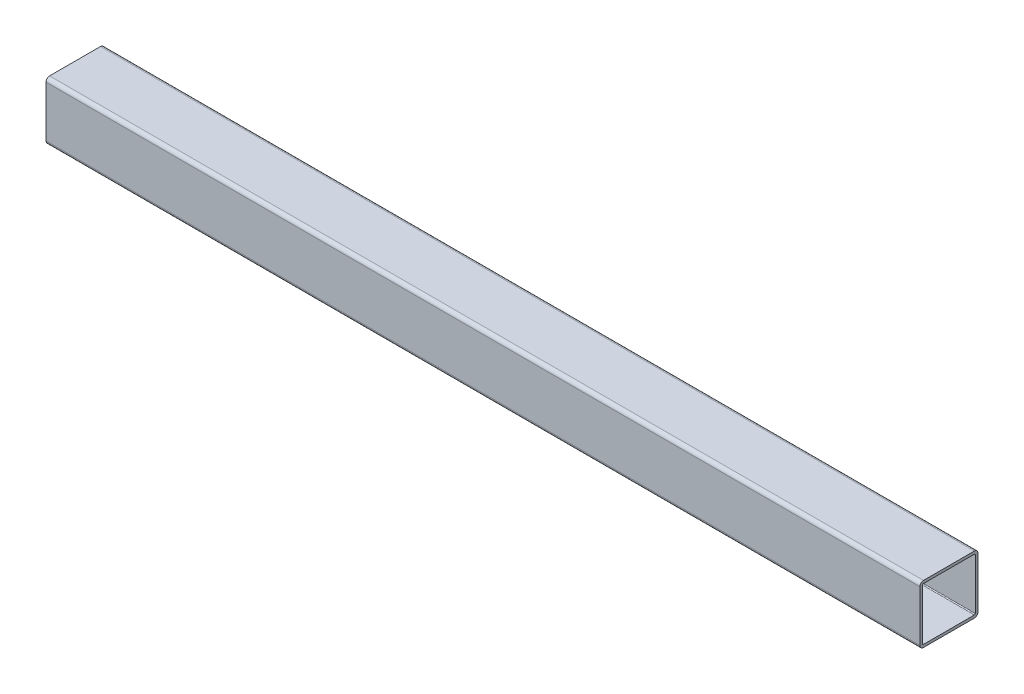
ISO-10303-21;
HEADER;
FILE_DESCRIPTION(('STEP AP214'),'2;1');
FILE_NAME('part.step','',(''),(''),'','','');
FILE_SCHEMA(('AUTOMOTIVE_DESIGN { 1 0 10303 214 1 1 1 1 }'));
ENDSEC;
DATA;
#1=APPLICATION_CONTEXT('core data for automotive mechanical design processes');
#2=APPLICATION_PROTOCOL_DEFINITION('international standard','automotive_design',2000,#1);
#3=PRODUCT_CONTEXT('',#1,'mechanical');
#4=PRODUCT('Part','Part','',(#3));
#5=PRODUCT_RELATED_PRODUCT_CATEGORY('part','',(#4));
#6=PRODUCT_DEFINITION_FORMATION('','',#4);
#7=PRODUCT_DEFINITION_CONTEXT('part definition',#1,'design');
#8=PRODUCT_DEFINITION('design','',#6,#7);
#9=PRODUCT_DEFINITION_SHAPE('','',#8);
#10=(LENGTH_UNIT() NAMED_UNIT(*) SI_UNIT(.MILLI.,.METRE.));
#11=(NAMED_UNIT(*) PLANE_ANGLE_UNIT() SI_UNIT($,.RADIAN.));
#12=(NAMED_UNIT(*) SI_UNIT($,.STERADIAN.) SOLID_ANGLE_UNIT());
#13=UNCERTAINTY_MEASURE_WITH_UNIT(LENGTH_MEASURE(1.E-05),#10,'distance_accuracy_value','');
#14=(GEOMETRIC_REPRESENTATION_CONTEXT(3) GLOBAL_UNCERTAINTY_ASSIGNED_CONTEXT((#13)) GLOBAL_UNIT_ASSIGNED_CONTEXT((#10,
#11,#12)) REPRESENTATION_CONTEXT('',''));
#15=CARTESIAN_POINT('',(0.,0.,0.));
#16=DIRECTION('',(0.,0.,1.));
#17=DIRECTION('',(1.,0.,0.));
#18=AXIS2_PLACEMENT_3D('',#15,#16,#17);
#19=CARTESIAN_POINT('',(-228.6,44.4500000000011,-46.0375));
#20=DIRECTION('',(0.,0.,-1.));
#21=DIRECTION('',(0.,1.,0.));
#22=AXIS2_PLACEMENT_3D('',#19,#20,#21);
#23=PLANE('',#22);
#24=DIRECTION('',(1.,0.,0.));
#25=VECTOR('',#24,1.);
#26=CARTESIAN_POINT('',(-228.6,44.4500000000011,-46.0374999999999));
#27=LINE('',#26,#25);
#28=CARTESIAN_POINT('',(1057.148,44.4500000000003,-46.0375));
#29=VERTEX_POINT('',#28);
#30=CARTESIAN_POINT('',(-470.661999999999,44.4500000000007,-46.0374999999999));
#31=VERTEX_POINT('',#30);
#32=EDGE_CURVE('E211',#29,#31,#27,.F.);
#33=ORIENTED_EDGE('',*,*,#32,.T.);
#34=DIRECTION('',(0.,-1.,0.));
#35=VECTOR('',#34,1.);
#36=CARTESIAN_POINT('',(-470.661999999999,44.4500000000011,-46.0375));
#37=LINE('',#36,#35);
#38=CARTESIAN_POINT('',(-470.661999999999,-44.4500000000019,-46.0375));
#39=VERTEX_POINT('',#38);
#40=EDGE_CURVE('E287',#31,#39,#37,.T.);
#41=ORIENTED_EDGE('',*,*,#40,.T.);
#42=DIRECTION('',(1.,0.,0.));
#43=VECTOR('',#42,1.);
#44=CARTESIAN_POINT('',(-228.6,-44.4500000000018,-46.0375));
#45=LINE('',#44,#43);
#46=CARTESIAN_POINT('',(1057.148,-44.4500000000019,-46.0375));
#47=VERTEX_POINT('',#46);
#48=EDGE_CURVE('E208',#39,#47,#45,.T.);
#49=ORIENTED_EDGE('',*,*,#48,.T.);
#50=DIRECTION('',(0.,1.,0.));
#51=VECTOR('',#50,1.);
#52=CARTESIAN_POINT('',(1057.148,-44.4500000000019,-46.0375));
#53=LINE('',#52,#51);
#54=EDGE_CURVE('E248',#47,#29,#53,.T.);
#55=ORIENTED_EDGE('',*,*,#54,.T.);
#56=EDGE_LOOP('',(#33,#41,#49,#55));
#57=FACE_BOUND('',#56,.T.);
#58=ADVANCED_FACE('F38',(#57),#23,.F.);
#59=CARTESIAN_POINT('',(-228.6,44.4500000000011,-44.45));
#60=DIRECTION('',(1.,0.,0.));
#61=DIRECTION('',(0.,1.,0.));
#62=AXIS2_PLACEMENT_3D('',#59,#60,#61);
#63=CYLINDRICAL_SURFACE('',#62,1.58749999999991);
#64=DIRECTION('',(1.,0.,0.));
#65=VECTOR('',#64,1.);
#66=CARTESIAN_POINT('',(-228.6,46.0375000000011,-44.45));
#67=LINE('',#66,#65);
#68=CARTESIAN_POINT('',(1057.148,46.037500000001,-44.45));
#69=VERTEX_POINT('',#68);
#70=CARTESIAN_POINT('',(-470.661999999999,46.0375000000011,-44.45));
#71=VERTEX_POINT('',#70);
#72=EDGE_CURVE('E192',#69,#71,#67,.F.);
#73=ORIENTED_EDGE('',*,*,#72,.T.);
#74=CARTESIAN_POINT('',(-470.661999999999,44.4500000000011,-44.45));
#75=DIRECTION('',(1.,0.,0.));
#76=DIRECTION('',(0.,1.,0.));
#77=AXIS2_PLACEMENT_3D('',#74,#75,#76);
#78=CIRCLE('',#77,1.58749999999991);
#79=EDGE_CURVE('E289',#71,#31,#78,.F.);
#80=ORIENTED_EDGE('',*,*,#79,.T.);
#81=ORIENTED_EDGE('',*,*,#32,.F.);
#82=CARTESIAN_POINT('',(1057.148,44.4500000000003,-44.45));
#83=DIRECTION('',(1.,0.,0.));
#84=DIRECTION('',(0.,1.,0.));
#85=AXIS2_PLACEMENT_3D('',#82,#83,#84);
#86=CIRCLE('',#85,1.58750000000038);
#87=EDGE_CURVE('E265',#29,#69,#86,.T.);
#88=ORIENTED_EDGE('',*,*,#87,.T.);
#89=EDGE_LOOP('',(#73,#80,#81,#88));
#90=FACE_BOUND('',#89,.T.);
#91=ADVANCED_FACE('F390',(#90),#63,.F.);
#92=CARTESIAN_POINT('',(-228.6,-46.0375000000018,-44.45));
#93=DIRECTION('',(0.,-1.,0.));
#94=DIRECTION('',(1.,0.,0.));
#95=AXIS2_PLACEMENT_3D('',#92,#93,#94);
#96=PLANE('',#95);
#97=DIRECTION('',(1.,0.,0.));
#98=VECTOR('',#97,1.);
#99=CARTESIAN_POINT('',(-228.6,-46.0375000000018,-44.45));
#100=LINE('',#99,#98);
#101=CARTESIAN_POINT('',(1057.148,-46.0375000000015,-44.45));
#102=VERTEX_POINT('',#101);
#103=CARTESIAN_POINT('',(-470.661999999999,-46.0375000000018,-44.45));
#104=VERTEX_POINT('',#103);
#105=EDGE_CURVE('E207',#102,#104,#100,.F.);
#106=ORIENTED_EDGE('',*,*,#105,.T.);
#107=DIRECTION('',(0.,0.,1.));
#108=VECTOR('',#107,1.);
#109=CARTESIAN_POINT('',(-470.661999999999,-46.0375000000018,-44.45));
#110=LINE('',#109,#108);
#111=CARTESIAN_POINT('',(-470.661999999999,-46.0375000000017,44.45));
#112=VERTEX_POINT('',#111);
#113=EDGE_CURVE('E292',#104,#112,#110,.T.);
#114=ORIENTED_EDGE('',*,*,#113,.T.);
#115=DIRECTION('',(1.,0.,0.));
#116=VECTOR('',#115,1.);
#117=CARTESIAN_POINT('',(-228.6,-46.0375000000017,44.45));
#118=LINE('',#117,#116);
#119=CARTESIAN_POINT('',(1057.148,-46.0375000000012,44.45));
#120=VERTEX_POINT('',#119);
#121=EDGE_CURVE('E164',#112,#120,#118,.T.);
#122=ORIENTED_EDGE('',*,*,#121,.T.);
#123=DIRECTION('',(0.,0.,-1.));
#124=VECTOR('',#123,1.);
#125=CARTESIAN_POINT('',(1057.148,-46.0375000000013,44.45));
#126=LINE('',#125,#124);
#127=EDGE_CURVE('E253',#120,#102,#126,.T.);
#128=ORIENTED_EDGE('',*,*,#127,.T.);
#129=EDGE_LOOP('',(#106,#114,#122,#128));
#130=FACE_BOUND('',#129,.T.);
#131=ADVANCED_FACE('F399',(#130),#96,.F.);
#132=CARTESIAN_POINT('',(-228.6,-44.4500000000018,-44.45));
#133=DIRECTION('',(1.,0.,0.));
#134=DIRECTION('',(0.,1.,0.));
#135=AXIS2_PLACEMENT_3D('',#132,#133,#134);
#136=CYLINDRICAL_SURFACE('',#135,1.5875);
#137=ORIENTED_EDGE('',*,*,#48,.F.);
#138=CARTESIAN_POINT('',(-470.661999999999,-44.4500000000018,-44.45));
#139=DIRECTION('',(1.,0.,0.));
#140=DIRECTION('',(0.,1.,0.));
#141=AXIS2_PLACEMENT_3D('',#138,#139,#140);
#142=CIRCLE('',#141,1.5875);
#143=EDGE_CURVE('E284',#39,#104,#142,.F.);
#144=ORIENTED_EDGE('',*,*,#143,.T.);
#145=ORIENTED_EDGE('',*,*,#105,.F.);
#146=CARTESIAN_POINT('',(1057.148,-44.4500000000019,-44.45));
#147=DIRECTION('',(1.,0.,0.));
#148=DIRECTION('',(0.,1.,0.));
#149=AXIS2_PLACEMENT_3D('',#146,#147,#148);
#150=CIRCLE('',#149,1.58749999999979);
#151=EDGE_CURVE('E250',#102,#47,#150,.T.);
#152=ORIENTED_EDGE('',*,*,#151,.T.);
#153=EDGE_LOOP('',(#137,#144,#145,#152));
#154=FACE_BOUND('',#153,.T.);
#155=ADVANCED_FACE('F410',(#154),#136,.F.);
#156=CARTESIAN_POINT('',(-228.6,-50.8000000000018,-44.45));
#157=DIRECTION('',(0.,-1.,0.));
#158=DIRECTION('',(0.,0.,-1.));
#159=AXIS2_PLACEMENT_3D('',#156,#157,#158);
#160=PLANE('',#159);
#161=DIRECTION('',(0.,0.,1.));
#162=VECTOR('',#161,1.);
#163=CARTESIAN_POINT('',(-470.661999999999,-50.8000000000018,-44.45));
#164=LINE('',#163,#162);
#165=CARTESIAN_POINT('',(-470.661999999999,-50.8000000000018,-44.45));
#166=VERTEX_POINT('',#165);
#167=CARTESIAN_POINT('',(-470.661999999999,-50.8000000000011,44.45));
#168=VERTEX_POINT('',#167);
#169=EDGE_CURVE('E278',#166,#168,#164,.T.);
#170=ORIENTED_EDGE('',*,*,#169,.F.);
#171=DIRECTION('',(1.,0.,0.));
#172=VECTOR('',#171,1.);
#173=CARTESIAN_POINT('',(-228.6,-50.8000000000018,-44.45));
#174=LINE('',#173,#172);
#175=CARTESIAN_POINT('',(1057.148,-50.8000000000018,-44.45));
#176=VERTEX_POINT('',#175);
#177=EDGE_CURVE('E188',#176,#166,#174,.F.);
#178=ORIENTED_EDGE('',*,*,#177,.F.);
#179=DIRECTION('',(0.,0.,-1.));
#180=VECTOR('',#179,1.);
#181=CARTESIAN_POINT('',(1057.148,-50.8000000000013,44.45));
#182=LINE('',#181,#180);
#183=CARTESIAN_POINT('',(1057.148,-50.8000000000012,44.45));
#184=VERTEX_POINT('',#183);
#185=EDGE_CURVE('E182',#184,#176,#182,.T.);
#186=ORIENTED_EDGE('',*,*,#185,.F.);
#187=DIRECTION('',(1.,0.,0.));
#188=VECTOR('',#187,1.);
#189=CARTESIAN_POINT('',(-228.6,-50.8000000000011,44.45));
#190=LINE('',#189,#188);
#191=EDGE_CURVE('E204',#168,#184,#190,.T.);
#192=ORIENTED_EDGE('',*,*,#191,.F.);
#193=EDGE_LOOP('',(#170,#178,#186,#192));
#194=FACE_BOUND('',#193,.T.);
#195=ADVANCED_FACE('F324',(#194),#160,.T.);
#196=CARTESIAN_POINT('',(-228.6,-44.4500000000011,44.45));
#197=DIRECTION('',(1.,0.,0.));
#198=DIRECTION('',(0.,1.,0.));
#199=AXIS2_PLACEMENT_3D('',#196,#197,#198);
#200=CYLINDRICAL_SURFACE('',#199,6.35);
#201=CARTESIAN_POINT('',(-470.661999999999,-44.4500000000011,44.45));
#202=DIRECTION('',(1.,0.,0.));
#203=DIRECTION('',(0.,1.,0.));
#204=AXIS2_PLACEMENT_3D('',#201,#202,#203);
#205=CIRCLE('',#204,6.35);
#206=CARTESIAN_POINT('',(-470.661999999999,-44.4500000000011,50.8));
#207=VERTEX_POINT('',#206);
#208=EDGE_CURVE('E52',#168,#207,#205,.F.);
#209=ORIENTED_EDGE('',*,*,#208,.F.);
#210=ORIENTED_EDGE('',*,*,#191,.T.);
#211=CARTESIAN_POINT('',(1057.148,-44.4500000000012,44.45));
#212=DIRECTION('',(1.,0.,0.));
#213=DIRECTION('',(0.,1.,0.));
#214=AXIS2_PLACEMENT_3D('',#211,#212,#213);
#215=CIRCLE('',#214,6.35000000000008);
#216=CARTESIAN_POINT('',(1057.148,-44.4500000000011,50.8));
#217=VERTEX_POINT('',#216);
#218=EDGE_CURVE('E222',#217,#184,#215,.T.);
#219=ORIENTED_EDGE('',*,*,#218,.F.);
#220=DIRECTION('',(1.,0.,0.));
#221=VECTOR('',#220,1.);
#222=CARTESIAN_POINT('',(-228.6,-44.4500000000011,50.8));
#223=LINE('',#222,#221);
#224=EDGE_CURVE('E202',#207,#217,#223,.T.);
#225=ORIENTED_EDGE('',*,*,#224,.F.);
#226=EDGE_LOOP('',(#209,#210,#219,#225));
#227=FACE_BOUND('',#226,.T.);
#228=ADVANCED_FACE('F321',(#227),#200,.T.);
#229=CARTESIAN_POINT('',(-228.6,-44.4500000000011,50.8));
#230=DIRECTION('',(0.,0.,1.));
#231=DIRECTION('',(1.,0.,0.));
#232=AXIS2_PLACEMENT_3D('',#229,#230,#231);
#233=PLANE('',#232);
#234=DIRECTION('',(0.,1.,0.));
#235=VECTOR('',#234,1.);
#236=CARTESIAN_POINT('',(-470.662,-2545.54181399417,50.8000000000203));
#237=LINE('',#236,#235);
#238=CARTESIAN_POINT('',(-470.661999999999,44.4500000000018,50.8));
#239=VERTEX_POINT('',#238);
#240=EDGE_CURVE('E60',#207,#239,#237,.T.);
#241=ORIENTED_EDGE('',*,*,#240,.F.);
#242=ORIENTED_EDGE('',*,*,#224,.T.);
#243=DIRECTION('',(0.,-1.,0.));
#244=VECTOR('',#243,1.);
#245=CARTESIAN_POINT('',(1057.148,44.4500000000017,50.8));
#246=LINE('',#245,#244);
#247=CARTESIAN_POINT('',(1057.148,44.4500000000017,50.8000000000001));
#248=VERTEX_POINT('',#247);
#249=EDGE_CURVE('E228',#248,#217,#246,.T.);
#250=ORIENTED_EDGE('',*,*,#249,.F.);
#251=DIRECTION('',(1.,0.,0.));
#252=VECTOR('',#251,1.);
#253=CARTESIAN_POINT('',(-228.6,44.4500000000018,50.8));
#254=LINE('',#253,#252);
#255=EDGE_CURVE('E199',#239,#248,#254,.T.);
#256=ORIENTED_EDGE('',*,*,#255,.F.);
#257=EDGE_LOOP('',(#241,#242,#250,#256));
#258=FACE_BOUND('',#257,.T.);
#259=ADVANCED_FACE('F320',(#258),#233,.T.);
#260=CARTESIAN_POINT('',(-228.6,44.4500000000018,44.45));
#261=DIRECTION('',(1.,0.,0.));
#262=DIRECTION('',(0.,1.,0.));
#263=AXIS2_PLACEMENT_3D('',#260,#261,#262);
#264=CYLINDRICAL_SURFACE('',#263,6.35);
#265=CARTESIAN_POINT('',(-470.661999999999,44.4500000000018,44.45));
#266=DIRECTION('',(1.,0.,0.));
#267=DIRECTION('',(0.,1.,0.));
#268=AXIS2_PLACEMENT_3D('',#265,#266,#267);
#269=CIRCLE('',#268,6.35);
#270=CARTESIAN_POINT('',(-470.661999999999,50.8000000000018,44.45));
#271=VERTEX_POINT('',#270);
#272=EDGE_CURVE('E268',#239,#271,#269,.F.);
#273=ORIENTED_EDGE('',*,*,#272,.F.);
#274=ORIENTED_EDGE('',*,*,#255,.T.);
#275=CARTESIAN_POINT('',(1057.148,44.4500000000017,44.45));
#276=DIRECTION('',(1.,0.,0.));
#277=DIRECTION('',(0.,1.,0.));
#278=AXIS2_PLACEMENT_3D('',#275,#276,#277);
#279=CIRCLE('',#278,6.35000000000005);
#280=CARTESIAN_POINT('',(1057.148,50.8000000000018,44.45));
#281=VERTEX_POINT('',#280);
#282=EDGE_CURVE('E231',#281,#248,#279,.T.);
#283=ORIENTED_EDGE('',*,*,#282,.F.);
#284=DIRECTION('',(1.,0.,0.));
#285=VECTOR('',#284,1.);
#286=CARTESIAN_POINT('',(-228.6,50.8000000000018,44.45));
#287=LINE('',#286,#285);
#288=EDGE_CURVE('E196',#271,#281,#287,.T.);
#289=ORIENTED_EDGE('',*,*,#288,.F.);
#290=EDGE_LOOP('',(#273,#274,#283,#289));
#291=FACE_BOUND('',#290,.T.);
#292=ADVANCED_FACE('F316',(#291),#264,.T.);
#293=CARTESIAN_POINT('',(-228.6,50.8000000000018,44.45));
#294=DIRECTION('',(0.,1.,0.));
#295=DIRECTION('',(0.,0.,1.));
#296=AXIS2_PLACEMENT_3D('',#293,#294,#295);
#297=PLANE('',#296);
#298=DIRECTION('',(0.,0.,-1.));
#299=VECTOR('',#298,1.);
#300=CARTESIAN_POINT('',(-470.661999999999,50.8000000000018,44.45));
#301=LINE('',#300,#299);
#302=CARTESIAN_POINT('',(-470.661999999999,50.8000000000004,-44.45));
#303=VERTEX_POINT('',#302);
#304=EDGE_CURVE('E271',#271,#303,#301,.T.);
#305=ORIENTED_EDGE('',*,*,#304,.F.);
#306=ORIENTED_EDGE('',*,*,#288,.T.);
#307=DIRECTION('',(0.,0.,1.));
#308=VECTOR('',#307,1.);
#309=CARTESIAN_POINT('',(1057.148,50.8000000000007,-44.45));
#310=LINE('',#309,#308);
#311=CARTESIAN_POINT('',(1057.148,50.8000000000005,-44.45));
#312=VERTEX_POINT('',#311);
#313=EDGE_CURVE('E236',#312,#281,#310,.T.);
#314=ORIENTED_EDGE('',*,*,#313,.F.);
#315=DIRECTION('',(1.,0.,0.));
#316=VECTOR('',#315,1.);
#317=CARTESIAN_POINT('',(-228.6,50.8000000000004,-44.45));
#318=LINE('',#317,#316);
#319=EDGE_CURVE('E194',#303,#312,#318,.T.);
#320=ORIENTED_EDGE('',*,*,#319,.F.);
#321=EDGE_LOOP('',(#305,#306,#314,#320));
#322=FACE_BOUND('',#321,.T.);
#323=ADVANCED_FACE('F312',(#322),#297,.T.);
#324=CARTESIAN_POINT('',(-228.6,44.4500000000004,-44.45));
#325=DIRECTION('',(1.,0.,0.));
#326=DIRECTION('',(0.,1.,0.));
#327=AXIS2_PLACEMENT_3D('',#324,#325,#326);
#328=CYLINDRICAL_SURFACE('',#327,6.35);
#329=CARTESIAN_POINT('',(-470.661999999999,44.4500000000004,-44.45));
#330=DIRECTION('',(1.,0.,0.));
#331=DIRECTION('',(0.,1.,0.));
#332=AXIS2_PLACEMENT_3D('',#329,#330,#331);
#333=CIRCLE('',#332,6.35);
#334=CARTESIAN_POINT('',(-470.661999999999,44.4500000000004,-50.8));
#335=VERTEX_POINT('',#334);
#336=EDGE_CURVE('E274',#303,#335,#333,.F.);
#337=ORIENTED_EDGE('',*,*,#336,.F.);
#338=ORIENTED_EDGE('',*,*,#319,.T.);
#339=CARTESIAN_POINT('',(1057.148,44.4500000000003,-44.45));
#340=DIRECTION('',(1.,0.,0.));
#341=DIRECTION('',(0.,1.,0.));
#342=AXIS2_PLACEMENT_3D('',#339,#340,#341);
#343=CIRCLE('',#342,6.35000000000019);
#344=CARTESIAN_POINT('',(1057.148,44.4500000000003,-50.8));
#345=VERTEX_POINT('',#344);
#346=EDGE_CURVE('E240',#345,#312,#343,.T.);
#347=ORIENTED_EDGE('',*,*,#346,.F.);
#348=DIRECTION('',(-1.,0.,0.));
#349=VECTOR('',#348,1.);
#350=CARTESIAN_POINT('',(-228.6,44.4500000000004,-50.8));
#351=LINE('',#350,#349);
#352=EDGE_CURVE('E189',#335,#345,#351,.F.);
#353=ORIENTED_EDGE('',*,*,#352,.F.);
#354=EDGE_LOOP('',(#337,#338,#347,#353));
#355=FACE_BOUND('',#354,.T.);
#356=ADVANCED_FACE('F308',(#355),#328,.T.);
#357=CARTESIAN_POINT('',(-228.6,44.4500000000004,-50.8));
#358=DIRECTION('',(0.,0.,-1.));
#359=DIRECTION('',(-1.,0.,0.));
#360=AXIS2_PLACEMENT_3D('',#357,#358,#359);
#361=PLANE('',#360);
#362=DIRECTION('',(0.,1.,0.));
#363=VECTOR('',#362,1.);
#364=CARTESIAN_POINT('',(-470.662,-2545.54181399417,-50.7999999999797));
#365=LINE('',#364,#363);
#366=CARTESIAN_POINT('',(-470.661999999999,-44.4500000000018,-50.8));
#367=VERTEX_POINT('',#366);
#368=EDGE_CURVE('E297',#367,#335,#365,.T.);
#369=ORIENTED_EDGE('',*,*,#368,.T.);
#370=ORIENTED_EDGE('',*,*,#352,.T.);
#371=DIRECTION('',(0.,1.,0.));
#372=VECTOR('',#371,1.);
#373=CARTESIAN_POINT('',(1057.148,-44.4500000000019,-50.8));
#374=LINE('',#373,#372);
#375=CARTESIAN_POINT('',(1057.148,-44.4500000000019,-50.8));
#376=VERTEX_POINT('',#375);
#377=EDGE_CURVE('E243',#376,#345,#374,.T.);
#378=ORIENTED_EDGE('',*,*,#377,.F.);
#379=DIRECTION('',(1.,0.,0.));
#380=VECTOR('',#379,1.);
#381=CARTESIAN_POINT('',(-228.6,-44.4500000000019,-50.8));
#382=LINE('',#381,#380);
#383=EDGE_CURVE('E185',#367,#376,#382,.T.);
#384=ORIENTED_EDGE('',*,*,#383,.F.);
#385=EDGE_LOOP('',(#369,#370,#378,#384));
#386=FACE_BOUND('',#385,.T.);
#387=ADVANCED_FACE('F303',(#386),#361,.T.);
#388=CARTESIAN_POINT('',(-228.6,-44.4500000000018,-44.45));
#389=DIRECTION('',(1.,0.,0.));
#390=DIRECTION('',(0.,1.,0.));
#391=AXIS2_PLACEMENT_3D('',#388,#389,#390);
#392=CYLINDRICAL_SURFACE('',#391,6.35);
#393=CARTESIAN_POINT('',(-470.661999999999,-44.4500000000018,-44.45));
#394=DIRECTION('',(1.,0.,0.));
#395=DIRECTION('',(0.,1.,0.));
#396=AXIS2_PLACEMENT_3D('',#393,#394,#395);
#397=CIRCLE('',#396,6.35);
#398=EDGE_CURVE('E281',#367,#166,#397,.F.);
#399=ORIENTED_EDGE('',*,*,#398,.F.);
#400=ORIENTED_EDGE('',*,*,#383,.T.);
#401=CARTESIAN_POINT('',(1057.148,-44.4500000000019,-44.45));
#402=DIRECTION('',(1.,0.,0.));
#403=DIRECTION('',(0.,1.,0.));
#404=AXIS2_PLACEMENT_3D('',#401,#402,#403);
#405=CIRCLE('',#404,6.34999999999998);
#406=EDGE_CURVE('E246',#176,#376,#405,.T.);
#407=ORIENTED_EDGE('',*,*,#406,.F.);
#408=ORIENTED_EDGE('',*,*,#177,.T.);
#409=EDGE_LOOP('',(#399,#400,#407,#408));
#410=FACE_BOUND('',#409,.T.);
#411=ADVANCED_FACE('F326',(#410),#392,.T.);
#412=CARTESIAN_POINT('',(-228.6,46.0375000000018,44.45));
#413=DIRECTION('',(0.,1.,0.));
#414=DIRECTION('',(0.,0.,1.));
#415=AXIS2_PLACEMENT_3D('',#412,#413,#414);
#416=PLANE('',#415);
#417=DIRECTION('',(1.,0.,0.));
#418=VECTOR('',#417,1.);
#419=CARTESIAN_POINT('',(-228.6,46.0375000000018,44.45));
#420=LINE('',#419,#418);
#421=CARTESIAN_POINT('',(1057.148,46.037500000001,44.45));
#422=VERTEX_POINT('',#421);
#423=CARTESIAN_POINT('',(-470.661999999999,46.0375000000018,44.45));
#424=VERTEX_POINT('',#423);
#425=EDGE_CURVE('E172',#422,#424,#420,.F.);
#426=ORIENTED_EDGE('',*,*,#425,.T.);
#427=DIRECTION('',(0.,0.,-1.));
#428=VECTOR('',#427,1.);
#429=CARTESIAN_POINT('',(-470.661999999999,46.0375000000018,44.45));
#430=LINE('',#429,#428);
#431=EDGE_CURVE('E165',#424,#71,#430,.T.);
#432=ORIENTED_EDGE('',*,*,#431,.T.);
#433=ORIENTED_EDGE('',*,*,#72,.F.);
#434=DIRECTION('',(0.,0.,1.));
#435=VECTOR('',#434,1.);
#436=CARTESIAN_POINT('',(1057.148,46.037500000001,-44.45));
#437=LINE('',#436,#435);
#438=EDGE_CURVE('E262',#69,#422,#437,.T.);
#439=ORIENTED_EDGE('',*,*,#438,.T.);
#440=EDGE_LOOP('',(#426,#432,#433,#439));
#441=FACE_BOUND('',#440,.T.);
#442=ADVANCED_FACE('F328',(#441),#416,.F.);
#443=CARTESIAN_POINT('',(-228.6,-44.4500000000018,44.45));
#444=DIRECTION('',(1.,0.,0.));
#445=DIRECTION('',(0.,1.,0.));
#446=AXIS2_PLACEMENT_3D('',#443,#444,#445);
#447=CYLINDRICAL_SURFACE('',#446,1.58749999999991);
#448=ORIENTED_EDGE('',*,*,#121,.F.);
#449=CARTESIAN_POINT('',(-470.661999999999,-44.4500000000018,44.45));
#450=DIRECTION('',(1.,0.,0.));
#451=DIRECTION('',(0.,1.,0.));
#452=AXIS2_PLACEMENT_3D('',#449,#450,#451);
#453=CIRCLE('',#452,1.58749999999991);
#454=CARTESIAN_POINT('',(-470.661999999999,-44.4500000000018,46.0375));
#455=VERTEX_POINT('',#454);
#456=EDGE_CURVE('E151',#112,#455,#453,.F.);
#457=ORIENTED_EDGE('',*,*,#456,.T.);
#458=DIRECTION('',(1.,0.,0.));
#459=VECTOR('',#458,1.);
#460=CARTESIAN_POINT('',(-228.6,-44.4500000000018,46.0375));
#461=LINE('',#460,#459);
#462=CARTESIAN_POINT('',(1057.148,-44.4500000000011,46.0375));
#463=VERTEX_POINT('',#462);
#464=EDGE_CURVE('E162',#455,#463,#461,.T.);
#465=ORIENTED_EDGE('',*,*,#464,.T.);
#466=CARTESIAN_POINT('',(1057.148,-44.4500000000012,44.45));
#467=DIRECTION('',(1.,0.,0.));
#468=DIRECTION('',(0.,1.,0.));
#469=AXIS2_PLACEMENT_3D('',#466,#467,#468);
#470=CIRCLE('',#469,1.58750000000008);
#471=EDGE_CURVE('E256',#463,#120,#470,.T.);
#472=ORIENTED_EDGE('',*,*,#471,.T.);
#473=EDGE_LOOP('',(#448,#457,#465,#472));
#474=FACE_BOUND('',#473,.T.);
#475=ADVANCED_FACE('F160',(#474),#447,.F.);
#476=CARTESIAN_POINT('',(-228.6,44.4500000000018,44.45));
#477=DIRECTION('',(1.,0.,0.));
#478=DIRECTION('',(0.,1.,0.));
#479=AXIS2_PLACEMENT_3D('',#476,#477,#478);
#480=CYLINDRICAL_SURFACE('',#479,1.5875);
#481=DIRECTION('',(1.,0.,0.));
#482=VECTOR('',#481,1.);
#483=CARTESIAN_POINT('',(-228.6,44.4500000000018,46.0375));
#484=LINE('',#483,#482);
#485=CARTESIAN_POINT('',(1057.148,44.4500000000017,46.0374999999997));
#486=VERTEX_POINT('',#485);
#487=CARTESIAN_POINT('',(-470.661999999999,44.4500000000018,46.0375));
#488=VERTEX_POINT('',#487);
#489=EDGE_CURVE('E45',#486,#488,#484,.F.);
#490=ORIENTED_EDGE('',*,*,#489,.T.);
#491=CARTESIAN_POINT('',(-470.661999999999,44.4500000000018,44.45));
#492=DIRECTION('',(1.,0.,0.));
#493=DIRECTION('',(0.,1.,0.));
#494=AXIS2_PLACEMENT_3D('',#491,#492,#493);
#495=CIRCLE('',#494,1.5875);
#496=EDGE_CURVE('E154',#488,#424,#495,.F.);
#497=ORIENTED_EDGE('',*,*,#496,.T.);
#498=ORIENTED_EDGE('',*,*,#425,.F.);
#499=CARTESIAN_POINT('',(1057.148,44.4500000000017,44.45));
#500=DIRECTION('',(1.,0.,0.));
#501=DIRECTION('',(0.,1.,0.));
#502=AXIS2_PLACEMENT_3D('',#499,#500,#501);
#503=CIRCLE('',#502,1.58749999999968);
#504=EDGE_CURVE('E259',#422,#486,#503,.T.);
#505=ORIENTED_EDGE('',*,*,#504,.T.);
#506=EDGE_LOOP('',(#490,#497,#498,#505));
#507=FACE_BOUND('',#506,.T.);
#508=ADVANCED_FACE('F338',(#507),#480,.F.);
#509=CARTESIAN_POINT('',(-228.6,-44.4500000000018,46.0375));
#510=DIRECTION('',(0.,0.,1.));
#511=DIRECTION('',(1.,0.,0.));
#512=AXIS2_PLACEMENT_3D('',#509,#510,#511);
#513=PLANE('',#512);
#514=ORIENTED_EDGE('',*,*,#464,.F.);
#515=DIRECTION('',(0.,1.,0.));
#516=VECTOR('',#515,1.);
#517=CARTESIAN_POINT('',(-470.661999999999,-44.4500000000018,46.0375));
#518=LINE('',#517,#516);
#519=EDGE_CURVE('E11',#455,#488,#518,.T.);
#520=ORIENTED_EDGE('',*,*,#519,.T.);
#521=ORIENTED_EDGE('',*,*,#489,.F.);
#522=DIRECTION('',(0.,-1.,0.));
#523=VECTOR('',#522,1.);
#524=CARTESIAN_POINT('',(1057.148,44.4500000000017,46.0375));
#525=LINE('',#524,#523);
#526=EDGE_CURVE('E169',#486,#463,#525,.T.);
#527=ORIENTED_EDGE('',*,*,#526,.T.);
#528=EDGE_LOOP('',(#514,#520,#521,#527));
#529=FACE_BOUND('',#528,.T.);
#530=ADVANCED_FACE('F167',(#529),#513,.F.);
#531=CARTESIAN_POINT('',(1057.148,-44.4500000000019,-44.45));
#532=DIRECTION('',(1.,0.,0.));
#533=DIRECTION('',(0.,1.,0.));
#534=AXIS2_PLACEMENT_3D('',#531,#532,#533);
#535=PLANE('',#534);
#536=ORIENTED_EDGE('',*,*,#406,.T.);
#537=ORIENTED_EDGE('',*,*,#377,.T.);
#538=ORIENTED_EDGE('',*,*,#346,.T.);
#539=ORIENTED_EDGE('',*,*,#313,.T.);
#540=ORIENTED_EDGE('',*,*,#282,.T.);
#541=ORIENTED_EDGE('',*,*,#249,.T.);
#542=ORIENTED_EDGE('',*,*,#218,.T.);
#543=ORIENTED_EDGE('',*,*,#185,.T.);
#544=EDGE_LOOP('',(#536,#537,#538,#539,#540,#541,#542,#543));
#545=FACE_BOUND('',#544,.T.);
#546=ORIENTED_EDGE('',*,*,#438,.F.);
#547=ORIENTED_EDGE('',*,*,#87,.F.);
#548=ORIENTED_EDGE('',*,*,#54,.F.);
#549=ORIENTED_EDGE('',*,*,#151,.F.);
#550=ORIENTED_EDGE('',*,*,#127,.F.);
#551=ORIENTED_EDGE('',*,*,#471,.F.);
#552=ORIENTED_EDGE('',*,*,#526,.F.);
#553=ORIENTED_EDGE('',*,*,#504,.F.);
#554=EDGE_LOOP('',(#546,#547,#548,#549,#550,#551,#552,#553));
#555=FACE_BOUND('',#554,.T.);
#556=ADVANCED_FACE('F318',(#545,#555),#535,.T.);
#557=CARTESIAN_POINT('',(-470.662,-2545.54181399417,50.8000000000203));
#558=DIRECTION('',(1.,0.,0.));
#559=DIRECTION('',(0.,1.,0.));
#560=AXIS2_PLACEMENT_3D('',#557,#558,#559);
#561=PLANE('',#560);
#562=ORIENTED_EDGE('',*,*,#240,.T.);
#563=ORIENTED_EDGE('',*,*,#272,.T.);
#564=ORIENTED_EDGE('',*,*,#304,.T.);
#565=ORIENTED_EDGE('',*,*,#336,.T.);
#566=ORIENTED_EDGE('',*,*,#368,.F.);
#567=ORIENTED_EDGE('',*,*,#398,.T.);
#568=ORIENTED_EDGE('',*,*,#169,.T.);
#569=ORIENTED_EDGE('',*,*,#208,.T.);
#570=EDGE_LOOP('',(#562,#563,#564,#565,#566,#567,#568,#569));
#571=FACE_BOUND('',#570,.T.);
#572=ORIENTED_EDGE('',*,*,#143,.F.);
#573=ORIENTED_EDGE('',*,*,#40,.F.);
#574=ORIENTED_EDGE('',*,*,#79,.F.);
#575=ORIENTED_EDGE('',*,*,#431,.F.);
#576=ORIENTED_EDGE('',*,*,#496,.F.);
#577=ORIENTED_EDGE('',*,*,#519,.F.);
#578=ORIENTED_EDGE('',*,*,#456,.F.);
#579=ORIENTED_EDGE('',*,*,#113,.F.);
#580=EDGE_LOOP('',(#572,#573,#574,#575,#576,#577,#578,#579));
#581=FACE_BOUND('',#580,.T.);
#582=ADVANCED_FACE('F150',(#571,#581),#561,.F.);
#583=CLOSED_SHELL('',(#58,#91,#131,#155,#195,#228,#259,#292,#323,#356,#387,#411,#442,#475,#508,
#530,#556,#582));
#584=MANIFOLD_SOLID_BREP('B2',#583);
#585=ADVANCED_BREP_SHAPE_REPRESENTATION('',(#18,#584),#14);
#586=SHAPE_DEFINITION_REPRESENTATION(#9,#585);
ENDSEC;
END-ISO-10303-21;
